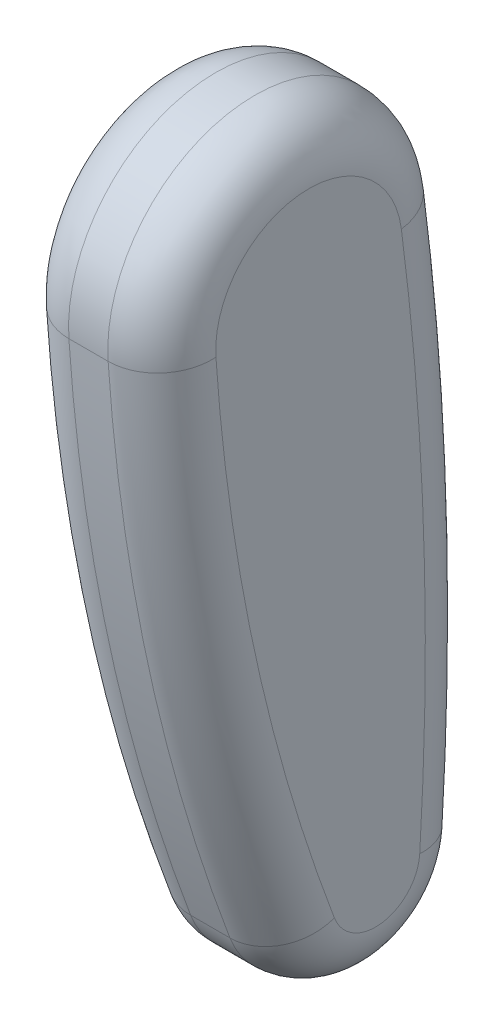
ISO-10303-21;
HEADER;
FILE_DESCRIPTION(('STEP AP214'),'2;1');
FILE_NAME('part.step','',(''),(''),'','','');
FILE_SCHEMA(('AUTOMOTIVE_DESIGN { 1 0 10303 214 1 1 1 1 }'));
ENDSEC;
DATA;
#1=APPLICATION_CONTEXT('core data for automotive mechanical design processes');
#2=APPLICATION_PROTOCOL_DEFINITION('international standard','automotive_design',2000,#1);
#3=PRODUCT_CONTEXT('',#1,'mechanical');
#4=PRODUCT('Part','Part','',(#3));
#5=PRODUCT_RELATED_PRODUCT_CATEGORY('part','',(#4));
#6=PRODUCT_DEFINITION_FORMATION('','',#4);
#7=PRODUCT_DEFINITION_CONTEXT('part definition',#1,'design');
#8=PRODUCT_DEFINITION('design','',#6,#7);
#9=PRODUCT_DEFINITION_SHAPE('','',#8);
#10=(LENGTH_UNIT() NAMED_UNIT(*) SI_UNIT(.MILLI.,.METRE.));
#11=(NAMED_UNIT(*) PLANE_ANGLE_UNIT() SI_UNIT($,.RADIAN.));
#12=(NAMED_UNIT(*) SI_UNIT($,.STERADIAN.) SOLID_ANGLE_UNIT());
#13=UNCERTAINTY_MEASURE_WITH_UNIT(LENGTH_MEASURE(1.E-05),#10,'distance_accuracy_value','');
#14=(GEOMETRIC_REPRESENTATION_CONTEXT(3) GLOBAL_UNCERTAINTY_ASSIGNED_CONTEXT((#13)) GLOBAL_UNIT_ASSIGNED_CONTEXT((#10,
#11,#12)) REPRESENTATION_CONTEXT('',''));
#15=CARTESIAN_POINT('',(0.,0.,0.));
#16=DIRECTION('',(0.,0.,1.));
#17=DIRECTION('',(1.,0.,0.));
#18=AXIS2_PLACEMENT_3D('',#15,#16,#17);
#19=CARTESIAN_POINT('',(292.1,256.100872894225,-943.602671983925));
#20=DIRECTION('',(-1.,0.,0.));
#21=DIRECTION('',(0.,0.,1.));
#22=AXIS2_PLACEMENT_3D('',#19,#20,#21);
#23=CYLINDRICAL_SURFACE('',#22,1016.);
#24=DIRECTION('',(-1.,0.,0.));
#25=VECTOR('',#24,1.);
#26=CARTESIAN_POINT('',(292.1,-102.421094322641,7.03816399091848));
#27=LINE('',#26,#25);
#28=CARTESIAN_POINT('',(264.16,-102.421094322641,7.03816399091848));
#29=VERTEX_POINT('',#28);
#30=CARTESIAN_POINT('',(243.84,-102.421094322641,7.03816399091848));
#31=VERTEX_POINT('',#30);
#32=EDGE_CURVE('E123',#29,#31,#27,.T.);
#33=ORIENTED_EDGE('',*,*,#32,.F.);
#34=CARTESIAN_POINT('',(264.16,256.100872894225,-943.602671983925));
#35=DIRECTION('',(1.,0.,0.));
#36=DIRECTION('',(0.,0.,-1.));
#37=AXIS2_PLACEMENT_3D('',#34,#35,#36);
#38=CIRCLE('',#37,1016.);
#39=CARTESIAN_POINT('',(264.16,187.624314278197,70.0871034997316));
#40=VERTEX_POINT('',#39);
#41=EDGE_CURVE('E11',#29,#40,#38,.F.);
#42=ORIENTED_EDGE('',*,*,#41,.T.);
#43=DIRECTION('',(-1.,0.,0.));
#44=VECTOR('',#43,1.);
#45=CARTESIAN_POINT('',(292.1,187.624314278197,70.0871034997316));
#46=LINE('',#45,#44);
#47=CARTESIAN_POINT('',(243.84,187.624314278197,70.0871034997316));
#48=VERTEX_POINT('',#47);
#49=EDGE_CURVE('E129',#40,#48,#46,.T.);
#50=ORIENTED_EDGE('',*,*,#49,.T.);
#51=CARTESIAN_POINT('',(243.84,256.100872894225,-943.602671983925));
#52=DIRECTION('',(1.,0.,0.));
#53=DIRECTION('',(0.,0.,-1.));
#54=AXIS2_PLACEMENT_3D('',#51,#52,#53);
#55=CIRCLE('',#54,1016.);
#56=EDGE_CURVE('E44',#48,#31,#55,.T.);
#57=ORIENTED_EDGE('',*,*,#56,.T.);
#58=EDGE_LOOP('',(#33,#42,#50,#57));
#59=FACE_BOUND('',#58,.T.);
#60=ADVANCED_FACE('F35',(#59),#23,.T.);
#61=CARTESIAN_POINT('',(292.1,-84.4949959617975,-40.4938778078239));
#62=DIRECTION('',(-1.,0.,0.));
#63=DIRECTION('',(0.,0.,1.));
#64=AXIS2_PLACEMENT_3D('',#61,#62,#63);
#65=CYLINDRICAL_SURFACE('',#64,50.8000000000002);
#66=DIRECTION('',(-1.,0.,0.));
#67=VECTOR('',#66,1.);
#68=CARTESIAN_POINT('',(292.1,-87.6442779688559,-91.1961659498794));
#69=LINE('',#68,#67);
#70=CARTESIAN_POINT('',(264.16,-87.6442779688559,-91.1961659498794));
#71=VERTEX_POINT('',#70);
#72=CARTESIAN_POINT('',(243.84,-87.6442779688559,-91.1961659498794));
#73=VERTEX_POINT('',#72);
#74=EDGE_CURVE('E177',#71,#73,#69,.T.);
#75=ORIENTED_EDGE('',*,*,#74,.F.);
#76=CARTESIAN_POINT('',(264.16,-84.4949959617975,-40.4938778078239));
#77=DIRECTION('',(1.,0.,0.));
#78=DIRECTION('',(0.,0.,-1.));
#79=AXIS2_PLACEMENT_3D('',#76,#77,#78);
#80=CIRCLE('',#79,50.8000000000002);
#81=EDGE_CURVE('E58',#71,#29,#80,.F.);
#82=ORIENTED_EDGE('',*,*,#81,.T.);
#83=ORIENTED_EDGE('',*,*,#32,.T.);
#84=CARTESIAN_POINT('',(243.84,-84.4949959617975,-40.4938778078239));
#85=DIRECTION('',(1.,0.,0.));
#86=DIRECTION('',(0.,0.,-1.));
#87=AXIS2_PLACEMENT_3D('',#84,#85,#86);
#88=CIRCLE('',#87,50.8000000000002);
#89=EDGE_CURVE('E154',#31,#73,#88,.T.);
#90=ORIENTED_EDGE('',*,*,#89,.T.);
#91=EDGE_LOOP('',(#75,#82,#83,#90));
#92=FACE_BOUND('',#91,.T.);
#93=ADVANCED_FACE('F190',(#92),#65,.T.);
#94=CARTESIAN_POINT('',(292.1,6.83418224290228,1429.87247831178));
#95=DIRECTION('',(-1.,0.,0.));
#96=DIRECTION('',(0.,0.,1.));
#97=AXIS2_PLACEMENT_3D('',#94,#95,#96);
#98=CYLINDRICAL_SURFACE('',#97,1524.);
#99=DIRECTION('',(-1.,0.,0.));
#100=VECTOR('',#99,1.);
#101=CARTESIAN_POINT('',(292.1,202.545628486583,-81.5086879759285));
#102=LINE('',#101,#100);
#103=CARTESIAN_POINT('',(264.16,202.545628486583,-81.5086879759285));
#104=VERTEX_POINT('',#103);
#105=CARTESIAN_POINT('',(243.84,202.545628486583,-81.5086879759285));
#106=VERTEX_POINT('',#105);
#107=EDGE_CURVE('E180',#104,#106,#102,.T.);
#108=ORIENTED_EDGE('',*,*,#107,.F.);
#109=CARTESIAN_POINT('',(264.16,6.83418224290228,1429.87247831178));
#110=DIRECTION('',(1.,0.,0.));
#111=DIRECTION('',(0.,0.,-1.));
#112=AXIS2_PLACEMENT_3D('',#109,#110,#111);
#113=CIRCLE('',#112,1524.);
#114=EDGE_CURVE('E168',#104,#71,#113,.F.);
#115=ORIENTED_EDGE('',*,*,#114,.T.);
#116=ORIENTED_EDGE('',*,*,#74,.T.);
#117=CARTESIAN_POINT('',(243.84,6.83418224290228,1429.87247831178));
#118=DIRECTION('',(1.,0.,0.));
#119=DIRECTION('',(0.,0.,-1.));
#120=AXIS2_PLACEMENT_3D('',#117,#118,#119);
#121=CIRCLE('',#120,1524.);
#122=EDGE_CURVE('E171',#73,#106,#121,.T.);
#123=ORIENTED_EDGE('',*,*,#122,.T.);
#124=EDGE_LOOP('',(#108,#115,#116,#123));
#125=FACE_BOUND('',#124,.T.);
#126=ADVANCED_FACE('F193',(#125),#98,.T.);
#127=CARTESIAN_POINT('',(292.1,192.760056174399,-5.93962966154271));
#128=DIRECTION('',(-1.,0.,0.));
#129=DIRECTION('',(0.,0.,1.));
#130=AXIS2_PLACEMENT_3D('',#127,#128,#129);
#131=CYLINDRICAL_SURFACE('',#130,76.2000000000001);
#132=ORIENTED_EDGE('',*,*,#49,.F.);
#133=CARTESIAN_POINT('',(264.16,192.760056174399,-5.93962966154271));
#134=DIRECTION('',(1.,0.,0.));
#135=DIRECTION('',(0.,0.,-1.));
#136=AXIS2_PLACEMENT_3D('',#133,#134,#135);
#137=CIRCLE('',#136,76.2000000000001);
#138=EDGE_CURVE('E126',#40,#104,#137,.F.);
#139=ORIENTED_EDGE('',*,*,#138,.T.);
#140=ORIENTED_EDGE('',*,*,#107,.T.);
#141=CARTESIAN_POINT('',(243.84,192.760056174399,-5.93962966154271));
#142=DIRECTION('',(1.,0.,0.));
#143=DIRECTION('',(0.,0.,-1.));
#144=AXIS2_PLACEMENT_3D('',#141,#142,#143);
#145=CIRCLE('',#144,76.2000000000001);
#146=EDGE_CURVE('E157',#106,#48,#145,.T.);
#147=ORIENTED_EDGE('',*,*,#146,.T.);
#148=EDGE_LOOP('',(#132,#139,#140,#147));
#149=FACE_BOUND('',#148,.T.);
#150=ADVANCED_FACE('F236',(#149),#131,.T.);
#151=CARTESIAN_POINT('',(292.1,85.8029384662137,-492.048274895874));
#152=DIRECTION('',(1.,0.,0.));
#153=DIRECTION('',(0.,0.,-1.));
#154=AXIS2_PLACEMENT_3D('',#151,#152,#153);
#155=PLANE('',#154);
#156=CARTESIAN_POINT('',(292.1,-84.4949959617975,-40.4938778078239));
#157=DIRECTION('',(1.,0.,0.));
#158=DIRECTION('',(0.,0.,-1.));
#159=AXIS2_PLACEMENT_3D('',#156,#157,#158);
#160=CIRCLE('',#159,22.8600000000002);
#161=CARTESIAN_POINT('',(292.1,-92.5617402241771,-19.1044589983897));
#162=VERTEX_POINT('',#161);
#163=CARTESIAN_POINT('',(292.1,-85.9121728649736,-63.309907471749));
#164=VERTEX_POINT('',#163);
#165=EDGE_CURVE('E112',#162,#164,#160,.T.);
#166=ORIENTED_EDGE('',*,*,#165,.T.);
#167=CARTESIAN_POINT('',(292.1,6.83418224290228,1429.87247831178));
#168=DIRECTION('',(1.,0.,0.));
#169=DIRECTION('',(0.,0.,-1.));
#170=AXIS2_PLACEMENT_3D('',#167,#168,#169);
#171=CIRCLE('',#170,1496.06);
#172=CARTESIAN_POINT('',(292.1,198.957585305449,-53.8000332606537));
#173=VERTEX_POINT('',#172);
#174=EDGE_CURVE('E108',#164,#173,#171,.T.);
#175=ORIENTED_EDGE('',*,*,#174,.T.);
#176=CARTESIAN_POINT('',(292.1,192.760056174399,-5.93962966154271));
#177=DIRECTION('',(1.,0.,0.));
#178=DIRECTION('',(0.,0.,-1.));
#179=AXIS2_PLACEMENT_3D('',#176,#177,#178);
#180=CIRCLE('',#179,48.2600000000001);
#181=CARTESIAN_POINT('',(292.1,189.507419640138,42.2106346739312));
#182=VERTEX_POINT('',#181);
#183=EDGE_CURVE('E102',#173,#182,#180,.T.);
#184=ORIENTED_EDGE('',*,*,#183,.T.);
#185=CARTESIAN_POINT('',(292.1,256.100872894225,-943.602671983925));
#186=DIRECTION('',(1.,0.,0.));
#187=DIRECTION('',(0.,0.,-1.));
#188=AXIS2_PLACEMENT_3D('',#185,#186,#187);
#189=CIRCLE('',#188,988.06);
#190=EDGE_CURVE('E105',#182,#162,#189,.T.);
#191=ORIENTED_EDGE('',*,*,#190,.T.);
#192=EDGE_LOOP('',(#166,#175,#184,#191));
#193=FACE_BOUND('',#192,.T.);
#194=ADVANCED_FACE('F104',(#193),#155,.T.);
#195=CARTESIAN_POINT('',(215.9,85.8029384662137,-492.048274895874));
#196=DIRECTION('',(1.,0.,0.));
#197=DIRECTION('',(0.,0.,-1.));
#198=AXIS2_PLACEMENT_3D('',#195,#196,#197);
#199=PLANE('',#198);
#200=CARTESIAN_POINT('',(215.9,192.760056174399,-5.93962966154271));
#201=DIRECTION('',(1.,0.,0.));
#202=DIRECTION('',(0.,0.,-1.));
#203=AXIS2_PLACEMENT_3D('',#200,#201,#202);
#204=CIRCLE('',#203,48.2600000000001);
#205=CARTESIAN_POINT('',(215.9,189.507419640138,42.2106346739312));
#206=VERTEX_POINT('',#205);
#207=CARTESIAN_POINT('',(215.9,198.957585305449,-53.8000332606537));
#208=VERTEX_POINT('',#207);
#209=EDGE_CURVE('E162',#206,#208,#204,.F.);
#210=ORIENTED_EDGE('',*,*,#209,.T.);
#211=CARTESIAN_POINT('',(215.9,6.83418224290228,1429.87247831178));
#212=DIRECTION('',(1.,0.,0.));
#213=DIRECTION('',(0.,0.,-1.));
#214=AXIS2_PLACEMENT_3D('',#211,#212,#213);
#215=CIRCLE('',#214,1496.06);
#216=CARTESIAN_POINT('',(215.9,-85.9121728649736,-63.309907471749));
#217=VERTEX_POINT('',#216);
#218=EDGE_CURVE('E159',#208,#217,#215,.F.);
#219=ORIENTED_EDGE('',*,*,#218,.T.);
#220=CARTESIAN_POINT('',(215.9,-84.4949959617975,-40.4938778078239));
#221=DIRECTION('',(1.,0.,0.));
#222=DIRECTION('',(0.,0.,-1.));
#223=AXIS2_PLACEMENT_3D('',#220,#221,#222);
#224=CIRCLE('',#223,22.8600000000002);
#225=CARTESIAN_POINT('',(215.9,-92.5617402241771,-19.1044589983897));
#226=VERTEX_POINT('',#225);
#227=EDGE_CURVE('E164',#217,#226,#224,.F.);
#228=ORIENTED_EDGE('',*,*,#227,.T.);
#229=CARTESIAN_POINT('',(215.9,256.100872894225,-943.602671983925));
#230=DIRECTION('',(1.,0.,0.));
#231=DIRECTION('',(0.,0.,-1.));
#232=AXIS2_PLACEMENT_3D('',#229,#230,#231);
#233=CIRCLE('',#232,988.06);
#234=EDGE_CURVE('E166',#226,#206,#233,.F.);
#235=ORIENTED_EDGE('',*,*,#234,.T.);
#236=EDGE_LOOP('',(#210,#219,#228,#235));
#237=FACE_BOUND('',#236,.T.);
#238=ADVANCED_FACE('F205',(#237),#199,.F.);
#239=CARTESIAN_POINT('',(264.16,256.100872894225,-943.602671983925));
#240=DIRECTION('',(1.,0.,0.));
#241=DIRECTION('',(0.,0.,-1.));
#242=AXIS2_PLACEMENT_3D('',#239,#240,#241);
#243=TOROIDAL_SURFACE('',#242,988.06,27.94);
#244=CARTESIAN_POINT('',(264.16,189.507419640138,42.2106346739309));
#245=DIRECTION('',(0.,0.997726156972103,0.0673981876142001));
#246=DIRECTION('',(0.,-0.0673981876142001,0.997726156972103));
#247=AXIS2_PLACEMENT_3D('',#244,#245,#246);
#248=CIRCLE('',#247,27.94);
#249=EDGE_CURVE('E118',#40,#182,#248,.T.);
#250=ORIENTED_EDGE('',*,*,#249,.F.);
#251=ORIENTED_EDGE('',*,*,#41,.F.);
#252=CARTESIAN_POINT('',(264.16,-92.5617402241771,-19.1044589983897));
#253=DIRECTION('',(0.,-0.935670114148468,-0.352875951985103));
#254=DIRECTION('',(0.,0.352875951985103,-0.935670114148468));
#255=AXIS2_PLACEMENT_3D('',#252,#253,#254);
#256=CIRCLE('',#255,27.94);
#257=EDGE_CURVE('E121',#162,#29,#256,.T.);
#258=ORIENTED_EDGE('',*,*,#257,.F.);
#259=ORIENTED_EDGE('',*,*,#190,.F.);
#260=EDGE_LOOP('',(#250,#251,#258,#259));
#261=FACE_BOUND('',#260,.T.);
#262=ADVANCED_FACE('F116',(#261),#243,.T.);
#263=CARTESIAN_POINT('',(264.16,-84.4949959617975,-40.4938778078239));
#264=DIRECTION('',(1.,0.,0.));
#265=DIRECTION('',(0.,0.,-1.));
#266=AXIS2_PLACEMENT_3D('',#263,#264,#265);
#267=DEGENERATE_TOROIDAL_SURFACE('',#266,22.8600000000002,27.94,.T.);
#268=ORIENTED_EDGE('',*,*,#257,.T.);
#269=ORIENTED_EDGE('',*,*,#81,.F.);
#270=CARTESIAN_POINT('',(264.16,-85.9121728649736,-63.309907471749));
#271=DIRECTION('',(0.,0.998076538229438,-0.0619937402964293));
#272=DIRECTION('',(0.,0.0619937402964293,0.998076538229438));
#273=AXIS2_PLACEMENT_3D('',#270,#271,#272);
#274=CIRCLE('',#273,27.94);
#275=EDGE_CURVE('E127',#164,#71,#274,.T.);
#276=ORIENTED_EDGE('',*,*,#275,.F.);
#277=ORIENTED_EDGE('',*,*,#165,.F.);
#278=EDGE_LOOP('',(#268,#269,#276,#277));
#279=FACE_BOUND('',#278,.T.);
#280=ADVANCED_FACE('F197',(#279),#267,.T.);
#281=CARTESIAN_POINT('',(264.16,192.760056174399,-5.93962966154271));
#282=DIRECTION('',(1.,0.,0.));
#283=DIRECTION('',(0.,0.,-1.));
#284=AXIS2_PLACEMENT_3D('',#281,#282,#283);
#285=TOROIDAL_SURFACE('',#284,48.2600000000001,27.94);
#286=ORIENTED_EDGE('',*,*,#249,.T.);
#287=ORIENTED_EDGE('',*,*,#183,.F.);
#288=CARTESIAN_POINT('',(264.16,198.957585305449,-53.8000332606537));
#289=DIRECTION('',(0.,-0.991719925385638,-0.128419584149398));
#290=DIRECTION('',(0.,0.128419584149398,-0.991719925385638));
#291=AXIS2_PLACEMENT_3D('',#288,#289,#290);
#292=CIRCLE('',#291,27.94);
#293=EDGE_CURVE('E131',#104,#173,#292,.T.);
#294=ORIENTED_EDGE('',*,*,#293,.F.);
#295=ORIENTED_EDGE('',*,*,#138,.F.);
#296=EDGE_LOOP('',(#286,#287,#294,#295));
#297=FACE_BOUND('',#296,.T.);
#298=ADVANCED_FACE('F125',(#297),#285,.T.);
#299=CARTESIAN_POINT('',(264.16,6.83418224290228,1429.87247831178));
#300=DIRECTION('',(1.,0.,0.));
#301=DIRECTION('',(0.,0.,-1.));
#302=AXIS2_PLACEMENT_3D('',#299,#300,#301);
#303=TOROIDAL_SURFACE('',#302,1496.06,27.94);
#304=ORIENTED_EDGE('',*,*,#275,.T.);
#305=ORIENTED_EDGE('',*,*,#114,.F.);
#306=ORIENTED_EDGE('',*,*,#293,.T.);
#307=ORIENTED_EDGE('',*,*,#174,.F.);
#308=EDGE_LOOP('',(#304,#305,#306,#307));
#309=FACE_BOUND('',#308,.T.);
#310=ADVANCED_FACE('F194',(#309),#303,.T.);
#311=CARTESIAN_POINT('',(243.84,256.100872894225,-943.602671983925));
#312=DIRECTION('',(1.,0.,0.));
#313=DIRECTION('',(0.,0.,-1.));
#314=AXIS2_PLACEMENT_3D('',#311,#312,#313);
#315=TOROIDAL_SURFACE('',#314,988.06,27.94);
#316=CARTESIAN_POINT('',(243.84,189.507419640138,42.2106346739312));
#317=DIRECTION('',(0.,0.997726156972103,0.0673981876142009));
#318=DIRECTION('',(0.,-0.0673981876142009,0.997726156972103));
#319=AXIS2_PLACEMENT_3D('',#316,#317,#318);
#320=CIRCLE('',#319,27.94);
#321=EDGE_CURVE('E138',#206,#48,#320,.T.);
#322=ORIENTED_EDGE('',*,*,#321,.F.);
#323=ORIENTED_EDGE('',*,*,#234,.F.);
#324=CARTESIAN_POINT('',(243.84,-92.561740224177,-19.1044589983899));
#325=DIRECTION('',(0.,-0.935670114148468,-0.352875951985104));
#326=DIRECTION('',(0.,0.352875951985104,-0.935670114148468));
#327=AXIS2_PLACEMENT_3D('',#324,#325,#326);
#328=CIRCLE('',#327,27.94);
#329=EDGE_CURVE('E39',#31,#226,#328,.T.);
#330=ORIENTED_EDGE('',*,*,#329,.F.);
#331=ORIENTED_EDGE('',*,*,#56,.F.);
#332=EDGE_LOOP('',(#322,#323,#330,#331));
#333=FACE_BOUND('',#332,.T.);
#334=ADVANCED_FACE('F37',(#333),#315,.T.);
#335=CARTESIAN_POINT('',(243.84,-84.4949959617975,-40.4938778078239));
#336=DIRECTION('',(1.,0.,0.));
#337=DIRECTION('',(0.,0.,-1.));
#338=AXIS2_PLACEMENT_3D('',#335,#336,#337);
#339=DEGENERATE_TOROIDAL_SURFACE('',#338,22.8600000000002,27.94,.T.);
#340=ORIENTED_EDGE('',*,*,#329,.T.);
#341=ORIENTED_EDGE('',*,*,#227,.F.);
#342=CARTESIAN_POINT('',(243.84,-85.9121728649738,-63.309907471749));
#343=DIRECTION('',(0.,0.998076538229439,-0.0619937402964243));
#344=DIRECTION('',(0.,0.0619937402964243,0.998076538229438));
#345=AXIS2_PLACEMENT_3D('',#342,#343,#344);
#346=CIRCLE('',#345,27.94);
#347=EDGE_CURVE('E137',#73,#217,#346,.T.);
#348=ORIENTED_EDGE('',*,*,#347,.F.);
#349=ORIENTED_EDGE('',*,*,#89,.F.);
#350=EDGE_LOOP('',(#340,#341,#348,#349));
#351=FACE_BOUND('',#350,.T.);
#352=ADVANCED_FACE('F188',(#351),#339,.T.);
#353=CARTESIAN_POINT('',(243.84,192.760056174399,-5.93962966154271));
#354=DIRECTION('',(1.,0.,0.));
#355=DIRECTION('',(0.,0.,-1.));
#356=AXIS2_PLACEMENT_3D('',#353,#354,#355);
#357=TOROIDAL_SURFACE('',#356,48.2600000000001,27.94);
#358=ORIENTED_EDGE('',*,*,#321,.T.);
#359=ORIENTED_EDGE('',*,*,#146,.F.);
#360=CARTESIAN_POINT('',(243.84,198.957585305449,-53.8000332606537));
#361=DIRECTION('',(0.,-0.991719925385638,-0.128419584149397));
#362=DIRECTION('',(0.,0.128419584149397,-0.991719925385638));
#363=AXIS2_PLACEMENT_3D('',#360,#361,#362);
#364=CIRCLE('',#363,27.94);
#365=EDGE_CURVE('E135',#208,#106,#364,.T.);
#366=ORIENTED_EDGE('',*,*,#365,.F.);
#367=ORIENTED_EDGE('',*,*,#209,.F.);
#368=EDGE_LOOP('',(#358,#359,#366,#367));
#369=FACE_BOUND('',#368,.T.);
#370=ADVANCED_FACE('F222',(#369),#357,.T.);
#371=CARTESIAN_POINT('',(243.84,6.83418224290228,1429.87247831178));
#372=DIRECTION('',(1.,0.,0.));
#373=DIRECTION('',(0.,0.,-1.));
#374=AXIS2_PLACEMENT_3D('',#371,#372,#373);
#375=TOROIDAL_SURFACE('',#374,1496.06,27.94);
#376=ORIENTED_EDGE('',*,*,#347,.T.);
#377=ORIENTED_EDGE('',*,*,#218,.F.);
#378=ORIENTED_EDGE('',*,*,#365,.T.);
#379=ORIENTED_EDGE('',*,*,#122,.F.);
#380=EDGE_LOOP('',(#376,#377,#378,#379));
#381=FACE_BOUND('',#380,.T.);
#382=ADVANCED_FACE('F226',(#381),#375,.T.);
#383=CLOSED_SHELL('',(#60,#93,#126,#150,#194,#238,#262,#280,#298,#310,#334,#352,#370,#382));
#384=MANIFOLD_SOLID_BREP('B2',#383);
#385=ADVANCED_BREP_SHAPE_REPRESENTATION('',(#18,#384),#14);
#386=SHAPE_DEFINITION_REPRESENTATION(#9,#385);
ENDSEC;
END-ISO-10303-21;
